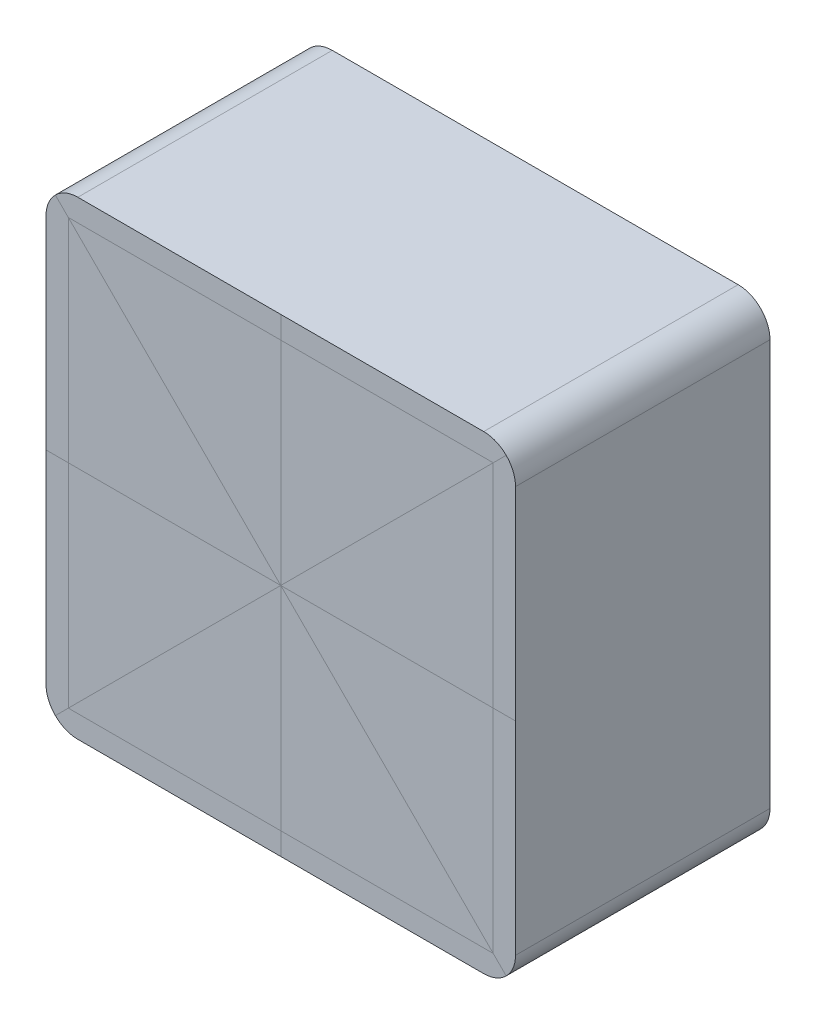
ISO-10303-21;
HEADER;
FILE_DESCRIPTION(('STEP AP214'),'2;1');
FILE_NAME('part.step','',(''),(''),'','','');
FILE_SCHEMA(('AUTOMOTIVE_DESIGN { 1 0 10303 214 1 1 1 1 }'));
ENDSEC;
DATA;
#1=APPLICATION_CONTEXT('core data for automotive mechanical design processes');
#2=APPLICATION_PROTOCOL_DEFINITION('international standard','automotive_design',2000,#1);
#3=PRODUCT_CONTEXT('',#1,'mechanical');
#4=PRODUCT('Part','Part','',(#3));
#5=PRODUCT_RELATED_PRODUCT_CATEGORY('part','',(#4));
#6=PRODUCT_DEFINITION_FORMATION('','',#4);
#7=PRODUCT_DEFINITION_CONTEXT('part definition',#1,'design');
#8=PRODUCT_DEFINITION('design','',#6,#7);
#9=PRODUCT_DEFINITION_SHAPE('','',#8);
#10=(LENGTH_UNIT() NAMED_UNIT(*) SI_UNIT(.MILLI.,.METRE.));
#11=(NAMED_UNIT(*) PLANE_ANGLE_UNIT() SI_UNIT($,.RADIAN.));
#12=(NAMED_UNIT(*) SI_UNIT($,.STERADIAN.) SOLID_ANGLE_UNIT());
#13=UNCERTAINTY_MEASURE_WITH_UNIT(LENGTH_MEASURE(1.E-05),#10,'distance_accuracy_value','');
#14=(GEOMETRIC_REPRESENTATION_CONTEXT(3) GLOBAL_UNCERTAINTY_ASSIGNED_CONTEXT((#13)) GLOBAL_UNIT_ASSIGNED_CONTEXT((#10,
#11,#12)) REPRESENTATION_CONTEXT('',''));
#15=CARTESIAN_POINT('',(0.,0.,0.));
#16=DIRECTION('',(0.,0.,1.));
#17=DIRECTION('',(1.,0.,0.));
#18=AXIS2_PLACEMENT_3D('',#15,#16,#17);
#19=CARTESIAN_POINT('',(7975.599999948,7975.599999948,0.));
#20=DIRECTION('',(0.,0.,1.));
#21=DIRECTION('',(1.,0.,0.));
#22=AXIS2_PLACEMENT_3D('',#19,#20,#21);
#23=PLANE('',#22);
#24=DIRECTION('',(0.,-1.,0.));
#25=VECTOR('',#24,1.);
#26=CARTESIAN_POINT('',(8350.,7975.599999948,0.));
#27=LINE('',#26,#25);
#28=CARTESIAN_POINT('',(8350.,8349.99999999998,0.));
#29=VERTEX_POINT('',#28);
#30=CARTESIAN_POINT('',(8350.,9.91003297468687E-13,0.));
#31=VERTEX_POINT('',#30);
#32=EDGE_CURVE('E11',#29,#31,#27,.T.);
#33=ORIENTED_EDGE('',*,*,#32,.F.);
#34=DIRECTION('',(-0.707106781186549,-0.707106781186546,0.));
#35=VECTOR('',#34,1.);
#36=CARTESIAN_POINT('',(7975.599999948,7975.59999994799,0.));
#37=LINE('',#36,#35);
#38=CARTESIAN_POINT('',(8859.05921239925,8859.05921239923,0.));
#39=VERTEX_POINT('',#38);
#40=EDGE_CURVE('E307',#39,#29,#37,.T.);
#41=ORIENTED_EDGE('',*,*,#40,.F.);
#42=CARTESIAN_POINT('',(7975.599999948,7975.599999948,0.));
#43=DIRECTION('',(0.,0.,1.));
#44=DIRECTION('',(1.,0.,0.));
#45=AXIS2_PLACEMENT_3D('',#42,#43,#44);
#46=CIRCLE('',#45,1249.400000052);
#47=CARTESIAN_POINT('',(9225.,7975.59999994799,0.));
#48=VERTEX_POINT('',#47);
#49=EDGE_CURVE('E547',#48,#39,#46,.T.);
#50=ORIENTED_EDGE('',*,*,#49,.F.);
#51=DIRECTION('',(0.,1.,0.));
#52=VECTOR('',#51,1.);
#53=CARTESIAN_POINT('',(9225.,-7975.59999994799,0.));
#54=LINE('',#53,#52);
#55=CARTESIAN_POINT('',(9225.,0.,0.));
#56=VERTEX_POINT('',#55);
#57=EDGE_CURVE('E504',#56,#48,#54,.T.);
#58=ORIENTED_EDGE('',*,*,#57,.F.);
#59=DIRECTION('',(-1.,0.,0.));
#60=VECTOR('',#59,1.);
#61=CARTESIAN_POINT('',(7975.599999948,8.88178419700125E-13,0.));
#62=LINE('',#61,#60);
#63=EDGE_CURVE('E291',#56,#31,#62,.T.);
#64=ORIENTED_EDGE('',*,*,#63,.T.);
#65=EDGE_LOOP('',(#33,#41,#50,#58,#64));
#66=FACE_BOUND('',#65,.T.);
#67=ADVANCED_FACE('F44',(#66),#23,.F.);
#68=DIRECTION('',(1.,0.,0.));
#69=VECTOR('',#68,1.);
#70=CARTESIAN_POINT('',(7975.599999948,8350.,0.));
#71=LINE('',#70,#69);
#72=CARTESIAN_POINT('',(-3.62148984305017E-12,8350.,0.));
#73=VERTEX_POINT('',#72);
#74=EDGE_CURVE('E54',#73,#29,#71,.T.);
#75=ORIENTED_EDGE('',*,*,#74,.F.);
#76=DIRECTION('',(0.,-1.,0.));
#77=VECTOR('',#76,1.);
#78=CARTESIAN_POINT('',(-3.5527136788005E-12,7975.59999994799,0.));
#79=LINE('',#78,#77);
#80=CARTESIAN_POINT('',(-1.77635683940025E-12,9225.,0.));
#81=VERTEX_POINT('',#80);
#82=EDGE_CURVE('E252',#81,#73,#79,.T.);
#83=ORIENTED_EDGE('',*,*,#82,.F.);
#84=DIRECTION('',(-1.,0.,0.));
#85=VECTOR('',#84,1.);
#86=CARTESIAN_POINT('',(-7975.59999994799,9225.,0.));
#87=LINE('',#86,#85);
#88=CARTESIAN_POINT('',(7975.59999994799,9225.,0.));
#89=VERTEX_POINT('',#88);
#90=EDGE_CURVE('E544',#89,#81,#87,.T.);
#91=ORIENTED_EDGE('',*,*,#90,.F.);
#92=EDGE_CURVE('E236',#39,#89,#46,.T.);
#93=ORIENTED_EDGE('',*,*,#92,.F.);
#94=ORIENTED_EDGE('',*,*,#40,.T.);
#95=EDGE_LOOP('',(#75,#83,#91,#93,#94));
#96=FACE_BOUND('',#95,.T.);
#97=ADVANCED_FACE('F621',(#96),#23,.F.);
#98=DIRECTION('',(1.,0.,0.));
#99=VECTOR('',#98,1.);
#100=CARTESIAN_POINT('',(7975.599999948,8350.,0.));
#101=LINE('',#100,#99);
#102=CARTESIAN_POINT('',(-8350.,8349.99999999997,0.));
#103=VERTEX_POINT('',#102);
#104=EDGE_CURVE('E319',#103,#73,#101,.T.);
#105=ORIENTED_EDGE('',*,*,#104,.F.);
#106=DIRECTION('',(0.707106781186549,-0.707106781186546,0.));
#107=VECTOR('',#106,1.);
#108=CARTESIAN_POINT('',(1.50990331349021E-11,-1.50990331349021E-11,0.));
#109=LINE('',#108,#107);
#110=CARTESIAN_POINT('',(-8859.05921239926,8859.05921239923,0.));
#111=VERTEX_POINT('',#110);
#112=EDGE_CURVE('E279',#111,#103,#109,.T.);
#113=ORIENTED_EDGE('',*,*,#112,.F.);
#114=CARTESIAN_POINT('',(-7975.599999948,7975.599999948,0.));
#115=DIRECTION('',(0.,0.,1.));
#116=DIRECTION('',(-1.,0.,0.));
#117=AXIS2_PLACEMENT_3D('',#114,#115,#116);
#118=CIRCLE('',#117,1249.400000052);
#119=CARTESIAN_POINT('',(-7975.59999994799,9225.,0.));
#120=VERTEX_POINT('',#119);
#121=EDGE_CURVE('E545',#120,#111,#118,.T.);
#122=ORIENTED_EDGE('',*,*,#121,.F.);
#123=EDGE_CURVE('E550',#81,#120,#87,.T.);
#124=ORIENTED_EDGE('',*,*,#123,.F.);
#125=ORIENTED_EDGE('',*,*,#82,.T.);
#126=EDGE_LOOP('',(#105,#113,#122,#124,#125));
#127=FACE_BOUND('',#126,.T.);
#128=ADVANCED_FACE('F627',(#127),#23,.F.);
#129=DIRECTION('',(0.,1.,0.));
#130=VECTOR('',#129,1.);
#131=CARTESIAN_POINT('',(-8350.,7975.59999994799,0.));
#132=LINE('',#131,#130);
#133=CARTESIAN_POINT('',(-8350.,-3.59546961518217E-12,0.));
#134=VERTEX_POINT('',#133);
#135=EDGE_CURVE('E323',#134,#103,#132,.T.);
#136=ORIENTED_EDGE('',*,*,#135,.F.);
#137=DIRECTION('',(-1.,0.,0.));
#138=VECTOR('',#137,1.);
#139=CARTESIAN_POINT('',(7975.599999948,8.88178419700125E-13,0.));
#140=LINE('',#139,#138);
#141=CARTESIAN_POINT('',(-9225.,-2.66453525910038E-12,0.));
#142=VERTEX_POINT('',#141);
#143=EDGE_CURVE('E280',#134,#142,#140,.T.);
#144=ORIENTED_EDGE('',*,*,#143,.T.);
#145=DIRECTION('',(0.,-1.,0.));
#146=VECTOR('',#145,1.);
#147=CARTESIAN_POINT('',(-9225.,-7975.59999994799,0.));
#148=LINE('',#147,#146);
#149=CARTESIAN_POINT('',(-9225.,7975.59999994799,0.));
#150=VERTEX_POINT('',#149);
#151=EDGE_CURVE('E527',#150,#142,#148,.T.);
#152=ORIENTED_EDGE('',*,*,#151,.F.);
#153=EDGE_CURVE('E536',#111,#150,#118,.T.);
#154=ORIENTED_EDGE('',*,*,#153,.F.);
#155=ORIENTED_EDGE('',*,*,#112,.T.);
#156=EDGE_LOOP('',(#136,#144,#152,#154,#155));
#157=FACE_BOUND('',#156,.T.);
#158=ADVANCED_FACE('F532',(#157),#23,.F.);
#159=DIRECTION('',(0.,1.,0.));
#160=VECTOR('',#159,1.);
#161=CARTESIAN_POINT('',(-8350.,7975.59999994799,0.));
#162=LINE('',#161,#160);
#163=CARTESIAN_POINT('',(-8350.00000000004,-8350.00000000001,0.));
#164=VERTEX_POINT('',#163);
#165=EDGE_CURVE('E347',#164,#134,#162,.T.);
#166=ORIENTED_EDGE('',*,*,#165,.F.);
#167=DIRECTION('',(-0.707106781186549,-0.707106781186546,0.));
#168=VECTOR('',#167,1.);
#169=CARTESIAN_POINT('',(7975.599999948,7975.59999994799,0.));
#170=LINE('',#169,#168);
#171=CARTESIAN_POINT('',(-8859.05921239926,-8859.05921239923,0.));
#172=VERTEX_POINT('',#171);
#173=EDGE_CURVE('E308',#164,#172,#170,.T.);
#174=ORIENTED_EDGE('',*,*,#173,.T.);
#175=CARTESIAN_POINT('',(-7975.599999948,-7975.599999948,0.));
#176=DIRECTION('',(0.,0.,1.));
#177=DIRECTION('',(1.,0.,0.));
#178=AXIS2_PLACEMENT_3D('',#175,#176,#177);
#179=CIRCLE('',#178,1249.400000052);
#180=CARTESIAN_POINT('',(-9225.,-7975.59999994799,0.));
#181=VERTEX_POINT('',#180);
#182=EDGE_CURVE('E492',#181,#172,#179,.T.);
#183=ORIENTED_EDGE('',*,*,#182,.F.);
#184=EDGE_CURVE('E541',#142,#181,#148,.T.);
#185=ORIENTED_EDGE('',*,*,#184,.F.);
#186=ORIENTED_EDGE('',*,*,#143,.F.);
#187=EDGE_LOOP('',(#166,#174,#183,#185,#186));
#188=FACE_BOUND('',#187,.T.);
#189=ADVANCED_FACE('F688',(#188),#23,.F.);
#190=DIRECTION('',(-1.,0.,0.));
#191=VECTOR('',#190,1.);
#192=CARTESIAN_POINT('',(7975.599999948,-8350.00000000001,0.));
#193=LINE('',#192,#191);
#194=CARTESIAN_POINT('',(-5.53749611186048E-13,-8350.00000000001,0.));
#195=VERTEX_POINT('',#194);
#196=EDGE_CURVE('E348',#195,#164,#193,.T.);
#197=ORIENTED_EDGE('',*,*,#196,.F.);
#198=CARTESIAN_POINT('',(-1.77635683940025E-12,-9225.,0.));
#199=VERTEX_POINT('',#198);
#200=EDGE_CURVE('E261',#195,#199,#79,.T.);
#201=ORIENTED_EDGE('',*,*,#200,.T.);
#202=DIRECTION('',(1.,0.,0.));
#203=VECTOR('',#202,1.);
#204=CARTESIAN_POINT('',(-7975.59999994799,-9225.,0.));
#205=LINE('',#204,#203);
#206=CARTESIAN_POINT('',(-7975.59999994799,-9225.,0.));
#207=VERTEX_POINT('',#206);
#208=EDGE_CURVE('E485',#207,#199,#205,.T.);
#209=ORIENTED_EDGE('',*,*,#208,.F.);
#210=EDGE_CURVE('E539',#172,#207,#179,.T.);
#211=ORIENTED_EDGE('',*,*,#210,.F.);
#212=ORIENTED_EDGE('',*,*,#173,.F.);
#213=EDGE_LOOP('',(#197,#201,#209,#211,#212));
#214=FACE_BOUND('',#213,.T.);
#215=ADVANCED_FACE('F479',(#214),#23,.F.);
#216=DIRECTION('',(-1.,0.,0.));
#217=VECTOR('',#216,1.);
#218=CARTESIAN_POINT('',(7975.599999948,-8350.00000000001,0.));
#219=LINE('',#218,#217);
#220=CARTESIAN_POINT('',(8350.,-8349.99999999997,0.));
#221=VERTEX_POINT('',#220);
#222=EDGE_CURVE('E336',#221,#195,#219,.T.);
#223=ORIENTED_EDGE('',*,*,#222,.F.);
#224=DIRECTION('',(0.707106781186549,-0.707106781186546,0.));
#225=VECTOR('',#224,1.);
#226=CARTESIAN_POINT('',(1.50990331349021E-11,-1.50990331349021E-11,0.));
#227=LINE('',#226,#225);
#228=CARTESIAN_POINT('',(8859.05921239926,-8859.05921239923,0.));
#229=VERTEX_POINT('',#228);
#230=EDGE_CURVE('E266',#221,#229,#227,.T.);
#231=ORIENTED_EDGE('',*,*,#230,.T.);
#232=CARTESIAN_POINT('',(7975.599999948,-7975.599999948,0.));
#233=DIRECTION('',(0.,0.,1.));
#234=DIRECTION('',(1.,0.,0.));
#235=AXIS2_PLACEMENT_3D('',#232,#233,#234);
#236=CIRCLE('',#235,1249.400000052);
#237=CARTESIAN_POINT('',(7975.59999994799,-9225.,0.));
#238=VERTEX_POINT('',#237);
#239=EDGE_CURVE('E487',#238,#229,#236,.T.);
#240=ORIENTED_EDGE('',*,*,#239,.F.);
#241=EDGE_CURVE('E486',#199,#238,#205,.T.);
#242=ORIENTED_EDGE('',*,*,#241,.F.);
#243=ORIENTED_EDGE('',*,*,#200,.F.);
#244=EDGE_LOOP('',(#223,#231,#240,#242,#243));
#245=FACE_BOUND('',#244,.T.);
#246=ADVANCED_FACE('F490',(#245),#23,.F.);
#247=DIRECTION('',(0.,-1.,0.));
#248=VECTOR('',#247,1.);
#249=CARTESIAN_POINT('',(8350.,7975.599999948,0.));
#250=LINE('',#249,#248);
#251=EDGE_CURVE('E335',#31,#221,#250,.T.);
#252=ORIENTED_EDGE('',*,*,#251,.F.);
#253=ORIENTED_EDGE('',*,*,#63,.F.);
#254=CARTESIAN_POINT('',(9225.,-7975.59999994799,0.));
#255=VERTEX_POINT('',#254);
#256=EDGE_CURVE('E221',#255,#56,#54,.T.);
#257=ORIENTED_EDGE('',*,*,#256,.F.);
#258=EDGE_CURVE('E498',#229,#255,#236,.T.);
#259=ORIENTED_EDGE('',*,*,#258,.F.);
#260=ORIENTED_EDGE('',*,*,#230,.F.);
#261=EDGE_LOOP('',(#252,#253,#257,#259,#260));
#262=FACE_BOUND('',#261,.T.);
#263=ADVANCED_FACE('F595',(#262),#23,.F.);
#264=CARTESIAN_POINT('',(7975.599999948,7975.599999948,10000.));
#265=DIRECTION('',(0.,0.,1.));
#266=DIRECTION('',(1.,0.,0.));
#267=AXIS2_PLACEMENT_3D('',#264,#265,#266);
#268=PLANE('',#267);
#269=DIRECTION('',(-1.,0.,0.));
#270=VECTOR('',#269,1.);
#271=CARTESIAN_POINT('',(7975.599999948,8.88178419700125E-13,10000.));
#272=LINE('',#271,#270);
#273=CARTESIAN_POINT('',(-8350.,-3.59546961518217E-12,10000.));
#274=VERTEX_POINT('',#273);
#275=CARTESIAN_POINT('',(-9225.,-2.66453525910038E-12,10000.));
#276=VERTEX_POINT('',#275);
#277=EDGE_CURVE('E295',#274,#276,#272,.T.);
#278=ORIENTED_EDGE('',*,*,#277,.F.);
#279=DIRECTION('',(0.,1.,0.));
#280=VECTOR('',#279,1.);
#281=CARTESIAN_POINT('',(-8350.,7975.59999994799,10000.));
#282=LINE('',#281,#280);
#283=CARTESIAN_POINT('',(-8350.,8349.99999999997,10000.));
#284=VERTEX_POINT('',#283);
#285=EDGE_CURVE('E330',#274,#284,#282,.T.);
#286=ORIENTED_EDGE('',*,*,#285,.T.);
#287=DIRECTION('',(0.707106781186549,-0.707106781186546,0.));
#288=VECTOR('',#287,1.);
#289=CARTESIAN_POINT('',(1.50990331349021E-11,-1.50990331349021E-11,10000.));
#290=LINE('',#289,#288);
#291=CARTESIAN_POINT('',(-8859.05921239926,8859.05921239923,10000.));
#292=VERTEX_POINT('',#291);
#293=EDGE_CURVE('E268',#292,#284,#290,.T.);
#294=ORIENTED_EDGE('',*,*,#293,.F.);
#295=CARTESIAN_POINT('',(-7975.599999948,7975.599999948,10000.));
#296=DIRECTION('',(0.,0.,1.));
#297=DIRECTION('',(-1.,0.,0.));
#298=AXIS2_PLACEMENT_3D('',#295,#296,#297);
#299=CIRCLE('',#298,1249.400000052);
#300=CARTESIAN_POINT('',(-9225.,7975.59999994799,10000.));
#301=VERTEX_POINT('',#300);
#302=EDGE_CURVE('E231',#292,#301,#299,.T.);
#303=ORIENTED_EDGE('',*,*,#302,.T.);
#304=DIRECTION('',(0.,-1.,0.));
#305=VECTOR('',#304,1.);
#306=CARTESIAN_POINT('',(-9225.,-7975.59999994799,10000.));
#307=LINE('',#306,#305);
#308=EDGE_CURVE('E529',#301,#276,#307,.T.);
#309=ORIENTED_EDGE('',*,*,#308,.T.);
#310=EDGE_LOOP('',(#278,#286,#294,#303,#309));
#311=FACE_BOUND('',#310,.T.);
#312=ADVANCED_FACE('F573',(#311),#268,.T.);
#313=ORIENTED_EDGE('',*,*,#293,.T.);
#314=DIRECTION('',(1.,0.,0.));
#315=VECTOR('',#314,1.);
#316=CARTESIAN_POINT('',(7975.599999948,8350.,10000.));
#317=LINE('',#316,#315);
#318=CARTESIAN_POINT('',(-3.62148984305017E-12,8350.,10000.));
#319=VERTEX_POINT('',#318);
#320=EDGE_CURVE('E322',#284,#319,#317,.T.);
#321=ORIENTED_EDGE('',*,*,#320,.T.);
#322=DIRECTION('',(0.,-1.,0.));
#323=VECTOR('',#322,1.);
#324=CARTESIAN_POINT('',(-3.5527136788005E-12,7975.59999994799,10000.));
#325=LINE('',#324,#323);
#326=CARTESIAN_POINT('',(-1.77635683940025E-12,9225.,10000.));
#327=VERTEX_POINT('',#326);
#328=EDGE_CURVE('E256',#327,#319,#325,.T.);
#329=ORIENTED_EDGE('',*,*,#328,.F.);
#330=DIRECTION('',(-1.,0.,0.));
#331=VECTOR('',#330,1.);
#332=CARTESIAN_POINT('',(-7975.59999994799,9225.,10000.));
#333=LINE('',#332,#331);
#334=CARTESIAN_POINT('',(-7975.59999994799,9225.,10000.));
#335=VERTEX_POINT('',#334);
#336=EDGE_CURVE('E234',#327,#335,#333,.T.);
#337=ORIENTED_EDGE('',*,*,#336,.T.);
#338=EDGE_CURVE('E561',#335,#292,#299,.T.);
#339=ORIENTED_EDGE('',*,*,#338,.T.);
#340=EDGE_LOOP('',(#313,#321,#329,#337,#339));
#341=FACE_BOUND('',#340,.T.);
#342=ADVANCED_FACE('F566',(#341),#268,.T.);
#343=ORIENTED_EDGE('',*,*,#328,.T.);
#344=DIRECTION('',(1.,0.,0.));
#345=VECTOR('',#344,1.);
#346=CARTESIAN_POINT('',(7975.599999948,8350.,10000.));
#347=LINE('',#346,#345);
#348=CARTESIAN_POINT('',(8350.,8349.99999999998,10000.));
#349=VERTEX_POINT('',#348);
#350=EDGE_CURVE('E327',#319,#349,#347,.T.);
#351=ORIENTED_EDGE('',*,*,#350,.T.);
#352=DIRECTION('',(-0.707106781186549,-0.707106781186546,0.));
#353=VECTOR('',#352,1.);
#354=CARTESIAN_POINT('',(7975.599999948,7975.59999994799,10000.));
#355=LINE('',#354,#353);
#356=CARTESIAN_POINT('',(8859.05921239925,8859.05921239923,10000.));
#357=VERTEX_POINT('',#356);
#358=EDGE_CURVE('E217',#357,#349,#355,.T.);
#359=ORIENTED_EDGE('',*,*,#358,.F.);
#360=CARTESIAN_POINT('',(7975.599999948,7975.599999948,10000.));
#361=DIRECTION('',(0.,0.,1.));
#362=DIRECTION('',(1.,0.,0.));
#363=AXIS2_PLACEMENT_3D('',#360,#361,#362);
#364=CIRCLE('',#363,1249.400000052);
#365=CARTESIAN_POINT('',(7975.59999994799,9225.,10000.));
#366=VERTEX_POINT('',#365);
#367=EDGE_CURVE('E215',#357,#366,#364,.T.);
#368=ORIENTED_EDGE('',*,*,#367,.T.);
#369=EDGE_CURVE('E216',#366,#327,#333,.T.);
#370=ORIENTED_EDGE('',*,*,#369,.T.);
#371=EDGE_LOOP('',(#343,#351,#359,#368,#370));
#372=FACE_BOUND('',#371,.T.);
#373=ADVANCED_FACE('F214',(#372),#268,.T.);
#374=ORIENTED_EDGE('',*,*,#358,.T.);
#375=DIRECTION('',(0.,-1.,0.));
#376=VECTOR('',#375,1.);
#377=CARTESIAN_POINT('',(8350.,7975.599999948,10000.));
#378=LINE('',#377,#376);
#379=CARTESIAN_POINT('',(8350.,9.91003297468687E-13,10000.));
#380=VERTEX_POINT('',#379);
#381=EDGE_CURVE('E329',#349,#380,#378,.T.);
#382=ORIENTED_EDGE('',*,*,#381,.T.);
#383=DIRECTION('',(-1.,0.,0.));
#384=VECTOR('',#383,1.);
#385=CARTESIAN_POINT('',(7975.599999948,8.88178419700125E-13,10000.));
#386=LINE('',#385,#384);
#387=CARTESIAN_POINT('',(9225.,0.,10000.));
#388=VERTEX_POINT('',#387);
#389=EDGE_CURVE('E285',#388,#380,#386,.T.);
#390=ORIENTED_EDGE('',*,*,#389,.F.);
#391=DIRECTION('',(0.,1.,0.));
#392=VECTOR('',#391,1.);
#393=CARTESIAN_POINT('',(9225.,-7975.59999994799,10000.));
#394=LINE('',#393,#392);
#395=CARTESIAN_POINT('',(9225.,7975.59999994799,10000.));
#396=VERTEX_POINT('',#395);
#397=EDGE_CURVE('E555',#388,#396,#394,.T.);
#398=ORIENTED_EDGE('',*,*,#397,.T.);
#399=EDGE_CURVE('E224',#396,#357,#364,.T.);
#400=ORIENTED_EDGE('',*,*,#399,.T.);
#401=EDGE_LOOP('',(#374,#382,#390,#398,#400));
#402=FACE_BOUND('',#401,.T.);
#403=ADVANCED_FACE('F660',(#402),#268,.T.);
#404=ORIENTED_EDGE('',*,*,#389,.T.);
#405=DIRECTION('',(0.,-1.,0.));
#406=VECTOR('',#405,1.);
#407=CARTESIAN_POINT('',(8350.,7975.599999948,10000.));
#408=LINE('',#407,#406);
#409=CARTESIAN_POINT('',(8350.,-8349.99999999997,10000.));
#410=VERTEX_POINT('',#409);
#411=EDGE_CURVE('E338',#380,#410,#408,.T.);
#412=ORIENTED_EDGE('',*,*,#411,.T.);
#413=DIRECTION('',(0.707106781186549,-0.707106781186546,0.));
#414=VECTOR('',#413,1.);
#415=CARTESIAN_POINT('',(1.50990331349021E-11,-1.50990331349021E-11,10000.));
#416=LINE('',#415,#414);
#417=CARTESIAN_POINT('',(8859.05921239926,-8859.05921239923,10000.));
#418=VERTEX_POINT('',#417);
#419=EDGE_CURVE('E270',#410,#418,#416,.T.);
#420=ORIENTED_EDGE('',*,*,#419,.T.);
#421=CARTESIAN_POINT('',(7975.599999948,-7975.599999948,10000.));
#422=DIRECTION('',(0.,0.,1.));
#423=DIRECTION('',(1.,0.,0.));
#424=AXIS2_PLACEMENT_3D('',#421,#422,#423);
#425=CIRCLE('',#424,1249.400000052);
#426=CARTESIAN_POINT('',(9225.,-7975.59999994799,10000.));
#427=VERTEX_POINT('',#426);
#428=EDGE_CURVE('E556',#418,#427,#425,.T.);
#429=ORIENTED_EDGE('',*,*,#428,.T.);
#430=EDGE_CURVE('E515',#427,#388,#394,.T.);
#431=ORIENTED_EDGE('',*,*,#430,.T.);
#432=EDGE_LOOP('',(#404,#412,#420,#429,#431));
#433=FACE_BOUND('',#432,.T.);
#434=ADVANCED_FACE('F656',(#433),#268,.T.);
#435=ORIENTED_EDGE('',*,*,#419,.F.);
#436=DIRECTION('',(-1.,0.,0.));
#437=VECTOR('',#436,1.);
#438=CARTESIAN_POINT('',(7975.599999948,-8350.00000000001,10000.));
#439=LINE('',#438,#437);
#440=CARTESIAN_POINT('',(-5.53749611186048E-13,-8350.00000000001,10000.));
#441=VERTEX_POINT('',#440);
#442=EDGE_CURVE('E345',#410,#441,#439,.T.);
#443=ORIENTED_EDGE('',*,*,#442,.T.);
#444=CARTESIAN_POINT('',(-1.77635683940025E-12,-9225.,10000.));
#445=VERTEX_POINT('',#444);
#446=EDGE_CURVE('E238',#441,#445,#325,.T.);
#447=ORIENTED_EDGE('',*,*,#446,.T.);
#448=DIRECTION('',(1.,0.,0.));
#449=VECTOR('',#448,1.);
#450=CARTESIAN_POINT('',(-7975.59999994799,-9225.,10000.));
#451=LINE('',#450,#449);
#452=CARTESIAN_POINT('',(7975.59999994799,-9225.,10000.));
#453=VERTEX_POINT('',#452);
#454=EDGE_CURVE('E558',#445,#453,#451,.T.);
#455=ORIENTED_EDGE('',*,*,#454,.T.);
#456=EDGE_CURVE('E554',#453,#418,#425,.T.);
#457=ORIENTED_EDGE('',*,*,#456,.T.);
#458=EDGE_LOOP('',(#435,#443,#447,#455,#457));
#459=FACE_BOUND('',#458,.T.);
#460=ADVANCED_FACE('F654',(#459),#268,.T.);
#461=ORIENTED_EDGE('',*,*,#446,.F.);
#462=DIRECTION('',(-1.,0.,0.));
#463=VECTOR('',#462,1.);
#464=CARTESIAN_POINT('',(7975.599999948,-8350.00000000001,10000.));
#465=LINE('',#464,#463);
#466=CARTESIAN_POINT('',(-8350.00000000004,-8350.00000000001,10000.));
#467=VERTEX_POINT('',#466);
#468=EDGE_CURVE('E47',#441,#467,#465,.T.);
#469=ORIENTED_EDGE('',*,*,#468,.T.);
#470=DIRECTION('',(-0.707106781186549,-0.707106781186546,0.));
#471=VECTOR('',#470,1.);
#472=CARTESIAN_POINT('',(7975.599999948,7975.59999994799,10000.));
#473=LINE('',#472,#471);
#474=CARTESIAN_POINT('',(-8859.05921239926,-8859.05921239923,10000.));
#475=VERTEX_POINT('',#474);
#476=EDGE_CURVE('E303',#467,#475,#473,.T.);
#477=ORIENTED_EDGE('',*,*,#476,.T.);
#478=CARTESIAN_POINT('',(-7975.599999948,-7975.599999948,10000.));
#479=DIRECTION('',(0.,0.,1.));
#480=DIRECTION('',(1.,0.,0.));
#481=AXIS2_PLACEMENT_3D('',#478,#479,#480);
#482=CIRCLE('',#481,1249.400000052);
#483=CARTESIAN_POINT('',(-7975.59999994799,-9225.,10000.));
#484=VERTEX_POINT('',#483);
#485=EDGE_CURVE('E562',#475,#484,#482,.T.);
#486=ORIENTED_EDGE('',*,*,#485,.T.);
#487=EDGE_CURVE('E560',#484,#445,#451,.T.);
#488=ORIENTED_EDGE('',*,*,#487,.T.);
#489=EDGE_LOOP('',(#461,#469,#477,#486,#488));
#490=FACE_BOUND('',#489,.T.);
#491=ADVANCED_FACE('F372',(#490),#268,.T.);
#492=ORIENTED_EDGE('',*,*,#476,.F.);
#493=DIRECTION('',(0.,1.,0.));
#494=VECTOR('',#493,1.);
#495=CARTESIAN_POINT('',(-8350.,7975.59999994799,10000.));
#496=LINE('',#495,#494);
#497=EDGE_CURVE('E312',#467,#274,#496,.T.);
#498=ORIENTED_EDGE('',*,*,#497,.T.);
#499=ORIENTED_EDGE('',*,*,#277,.T.);
#500=CARTESIAN_POINT('',(-9225.,-7975.59999994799,10000.));
#501=VERTEX_POINT('',#500);
#502=EDGE_CURVE('E564',#276,#501,#307,.T.);
#503=ORIENTED_EDGE('',*,*,#502,.T.);
#504=EDGE_CURVE('E388',#501,#475,#482,.T.);
#505=ORIENTED_EDGE('',*,*,#504,.T.);
#506=EDGE_LOOP('',(#492,#498,#499,#503,#505));
#507=FACE_BOUND('',#506,.T.);
#508=ADVANCED_FACE('F389',(#507),#268,.T.);
#509=ORIENTED_EDGE('',*,*,#468,.F.);
#510=CARTESIAN_POINT('',(-2.67593781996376E-12,3.85257400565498E-12,10000.));
#511=VERTEX_POINT('',#510);
#512=EDGE_CURVE('E243',#511,#441,#325,.T.);
#513=ORIENTED_EDGE('',*,*,#512,.F.);
#514=EDGE_CURVE('E313',#511,#467,#473,.T.);
#515=ORIENTED_EDGE('',*,*,#514,.T.);
#516=EDGE_LOOP('',(#509,#513,#515));
#517=FACE_BOUND('',#516,.T.);
#518=ADVANCED_FACE('F395',(#517),#268,.T.);
#519=CARTESIAN_POINT('',(-2.67593781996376E-12,3.85257400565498E-12,0.));
#520=VERTEX_POINT('',#519);
#521=EDGE_CURVE('E260',#520,#195,#79,.T.);
#522=ORIENTED_EDGE('',*,*,#521,.T.);
#523=ORIENTED_EDGE('',*,*,#196,.T.);
#524=EDGE_CURVE('E302',#520,#164,#170,.T.);
#525=ORIENTED_EDGE('',*,*,#524,.F.);
#526=EDGE_LOOP('',(#522,#523,#525));
#527=FACE_BOUND('',#526,.T.);
#528=ADVANCED_FACE('F609',(#527),#23,.F.);
#529=EDGE_CURVE('E309',#29,#520,#37,.T.);
#530=ORIENTED_EDGE('',*,*,#529,.F.);
#531=ORIENTED_EDGE('',*,*,#32,.T.);
#532=EDGE_CURVE('E287',#31,#520,#62,.T.);
#533=ORIENTED_EDGE('',*,*,#532,.T.);
#534=EDGE_LOOP('',(#530,#531,#533));
#535=FACE_BOUND('',#534,.T.);
#536=ADVANCED_FACE('F608',(#535),#23,.F.);
#537=ORIENTED_EDGE('',*,*,#381,.F.);
#538=EDGE_CURVE('E296',#349,#511,#355,.T.);
#539=ORIENTED_EDGE('',*,*,#538,.T.);
#540=EDGE_CURVE('E290',#380,#511,#386,.T.);
#541=ORIENTED_EDGE('',*,*,#540,.F.);
#542=EDGE_LOOP('',(#537,#539,#541));
#543=FACE_BOUND('',#542,.T.);
#544=ADVANCED_FACE('F418',(#543),#268,.T.);
#545=ORIENTED_EDGE('',*,*,#532,.F.);
#546=ORIENTED_EDGE('',*,*,#251,.T.);
#547=EDGE_CURVE('E272',#520,#221,#227,.T.);
#548=ORIENTED_EDGE('',*,*,#547,.F.);
#549=EDGE_LOOP('',(#545,#546,#548));
#550=FACE_BOUND('',#549,.T.);
#551=ADVANCED_FACE('F620',(#550),#23,.F.);
#552=ORIENTED_EDGE('',*,*,#411,.F.);
#553=ORIENTED_EDGE('',*,*,#540,.T.);
#554=EDGE_CURVE('E265',#511,#410,#416,.T.);
#555=ORIENTED_EDGE('',*,*,#554,.T.);
#556=EDGE_LOOP('',(#552,#553,#555));
#557=FACE_BOUND('',#556,.T.);
#558=ADVANCED_FACE('F420',(#557),#268,.T.);
#559=ORIENTED_EDGE('',*,*,#497,.F.);
#560=ORIENTED_EDGE('',*,*,#514,.F.);
#561=EDGE_CURVE('E289',#511,#274,#272,.T.);
#562=ORIENTED_EDGE('',*,*,#561,.T.);
#563=EDGE_LOOP('',(#559,#560,#562));
#564=FACE_BOUND('',#563,.T.);
#565=ADVANCED_FACE('F382',(#564),#268,.T.);
#566=ORIENTED_EDGE('',*,*,#524,.T.);
#567=ORIENTED_EDGE('',*,*,#165,.T.);
#568=EDGE_CURVE('E300',#520,#134,#140,.T.);
#569=ORIENTED_EDGE('',*,*,#568,.F.);
#570=EDGE_LOOP('',(#566,#567,#569));
#571=FACE_BOUND('',#570,.T.);
#572=ADVANCED_FACE('F607',(#571),#23,.F.);
#573=EDGE_CURVE('E258',#73,#520,#79,.T.);
#574=ORIENTED_EDGE('',*,*,#573,.F.);
#575=ORIENTED_EDGE('',*,*,#74,.T.);
#576=ORIENTED_EDGE('',*,*,#529,.T.);
#577=EDGE_LOOP('',(#574,#575,#576));
#578=FACE_BOUND('',#577,.T.);
#579=ADVANCED_FACE('F642',(#578),#23,.F.);
#580=ORIENTED_EDGE('',*,*,#350,.F.);
#581=EDGE_CURVE('E247',#319,#511,#325,.T.);
#582=ORIENTED_EDGE('',*,*,#581,.T.);
#583=ORIENTED_EDGE('',*,*,#538,.F.);
#584=EDGE_LOOP('',(#580,#582,#583));
#585=FACE_BOUND('',#584,.T.);
#586=ADVANCED_FACE('F408',(#585),#268,.T.);
#587=ORIENTED_EDGE('',*,*,#320,.F.);
#588=EDGE_CURVE('E275',#284,#511,#290,.T.);
#589=ORIENTED_EDGE('',*,*,#588,.T.);
#590=ORIENTED_EDGE('',*,*,#581,.F.);
#591=EDGE_LOOP('',(#587,#589,#590));
#592=FACE_BOUND('',#591,.T.);
#593=ADVANCED_FACE('F577',(#592),#268,.T.);
#594=EDGE_CURVE('E254',#103,#520,#109,.T.);
#595=ORIENTED_EDGE('',*,*,#594,.F.);
#596=ORIENTED_EDGE('',*,*,#104,.T.);
#597=ORIENTED_EDGE('',*,*,#573,.T.);
#598=EDGE_LOOP('',(#595,#596,#597));
#599=FACE_BOUND('',#598,.T.);
#600=ADVANCED_FACE('F636',(#599),#23,.F.);
#601=ORIENTED_EDGE('',*,*,#547,.T.);
#602=ORIENTED_EDGE('',*,*,#222,.T.);
#603=ORIENTED_EDGE('',*,*,#521,.F.);
#604=EDGE_LOOP('',(#601,#602,#603));
#605=FACE_BOUND('',#604,.T.);
#606=ADVANCED_FACE('F632',(#605),#23,.F.);
#607=ORIENTED_EDGE('',*,*,#442,.F.);
#608=ORIENTED_EDGE('',*,*,#554,.F.);
#609=ORIENTED_EDGE('',*,*,#512,.T.);
#610=EDGE_LOOP('',(#607,#608,#609));
#611=FACE_BOUND('',#610,.T.);
#612=ADVANCED_FACE('F638',(#611),#268,.T.);
#613=CARTESIAN_POINT('',(7975.599999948,7975.599999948,10000.));
#614=DIRECTION('',(0.,0.,-1.));
#615=DIRECTION('',(-1.,0.,0.));
#616=AXIS2_PLACEMENT_3D('',#613,#614,#615);
#617=CYLINDRICAL_SURFACE('',#616,1249.400000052);
#618=ORIENTED_EDGE('',*,*,#49,.T.);
#619=ORIENTED_EDGE('',*,*,#92,.T.);
#620=DIRECTION('',(0.,0.,-1.));
#621=VECTOR('',#620,1.);
#622=CARTESIAN_POINT('',(7975.59999994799,9225.,10000.));
#623=LINE('',#622,#621);
#624=EDGE_CURVE('E232',#366,#89,#623,.T.);
#625=ORIENTED_EDGE('',*,*,#624,.F.);
#626=ORIENTED_EDGE('',*,*,#367,.F.);
#627=ORIENTED_EDGE('',*,*,#399,.F.);
#628=DIRECTION('',(0.,0.,-1.));
#629=VECTOR('',#628,1.);
#630=CARTESIAN_POINT('',(9225.,7975.59999994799,10000.));
#631=LINE('',#630,#629);
#632=EDGE_CURVE('E509',#396,#48,#631,.T.);
#633=ORIENTED_EDGE('',*,*,#632,.T.);
#634=EDGE_LOOP('',(#618,#619,#625,#626,#627,#633));
#635=FACE_BOUND('',#634,.T.);
#636=ADVANCED_FACE('F50',(#635),#617,.T.);
#637=CARTESIAN_POINT('',(-7975.59999994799,9225.,10000.));
#638=DIRECTION('',(0.,-1.,0.));
#639=DIRECTION('',(0.,0.,-1.));
#640=AXIS2_PLACEMENT_3D('',#637,#638,#639);
#641=PLANE('',#640);
#642=ORIENTED_EDGE('',*,*,#90,.T.);
#643=ORIENTED_EDGE('',*,*,#123,.T.);
#644=DIRECTION('',(0.,0.,-1.));
#645=VECTOR('',#644,1.);
#646=CARTESIAN_POINT('',(-7975.59999994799,9225.,10000.));
#647=LINE('',#646,#645);
#648=EDGE_CURVE('E241',#335,#120,#647,.T.);
#649=ORIENTED_EDGE('',*,*,#648,.F.);
#650=ORIENTED_EDGE('',*,*,#336,.F.);
#651=ORIENTED_EDGE('',*,*,#369,.F.);
#652=ORIENTED_EDGE('',*,*,#624,.T.);
#653=EDGE_LOOP('',(#642,#643,#649,#650,#651,#652));
#654=FACE_BOUND('',#653,.T.);
#655=ADVANCED_FACE('F229',(#654),#641,.F.);
#656=CARTESIAN_POINT('',(-7975.599999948,7975.599999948,10000.));
#657=DIRECTION('',(0.,0.,-1.));
#658=DIRECTION('',(-1.,0.,0.));
#659=AXIS2_PLACEMENT_3D('',#656,#657,#658);
#660=CYLINDRICAL_SURFACE('',#659,1249.400000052);
#661=ORIENTED_EDGE('',*,*,#121,.T.);
#662=ORIENTED_EDGE('',*,*,#153,.T.);
#663=DIRECTION('',(0.,0.,-1.));
#664=VECTOR('',#663,1.);
#665=CARTESIAN_POINT('',(-9225.,7975.59999994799,10000.));
#666=LINE('',#665,#664);
#667=EDGE_CURVE('E249',#301,#150,#666,.T.);
#668=ORIENTED_EDGE('',*,*,#667,.F.);
#669=ORIENTED_EDGE('',*,*,#302,.F.);
#670=ORIENTED_EDGE('',*,*,#338,.F.);
#671=ORIENTED_EDGE('',*,*,#648,.T.);
#672=EDGE_LOOP('',(#661,#662,#668,#669,#670,#671));
#673=FACE_BOUND('',#672,.T.);
#674=ADVANCED_FACE('F575',(#673),#660,.T.);
#675=CARTESIAN_POINT('',(-9225.,-7975.59999994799,10000.));
#676=DIRECTION('',(1.,0.,0.));
#677=DIRECTION('',(0.,0.,-1.));
#678=AXIS2_PLACEMENT_3D('',#675,#676,#677);
#679=PLANE('',#678);
#680=ORIENTED_EDGE('',*,*,#151,.T.);
#681=ORIENTED_EDGE('',*,*,#184,.T.);
#682=DIRECTION('',(0.,0.,-1.));
#683=VECTOR('',#682,1.);
#684=CARTESIAN_POINT('',(-9225.,-7975.59999994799,10000.));
#685=LINE('',#684,#683);
#686=EDGE_CURVE('E517',#501,#181,#685,.T.);
#687=ORIENTED_EDGE('',*,*,#686,.F.);
#688=ORIENTED_EDGE('',*,*,#502,.F.);
#689=ORIENTED_EDGE('',*,*,#308,.F.);
#690=ORIENTED_EDGE('',*,*,#667,.T.);
#691=EDGE_LOOP('',(#680,#681,#687,#688,#689,#690));
#692=FACE_BOUND('',#691,.T.);
#693=ADVANCED_FACE('F528',(#692),#679,.F.);
#694=CARTESIAN_POINT('',(-7975.599999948,-7975.599999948,10000.));
#695=DIRECTION('',(0.,0.,-1.));
#696=DIRECTION('',(-1.,0.,0.));
#697=AXIS2_PLACEMENT_3D('',#694,#695,#696);
#698=CYLINDRICAL_SURFACE('',#697,1249.400000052);
#699=ORIENTED_EDGE('',*,*,#182,.T.);
#700=ORIENTED_EDGE('',*,*,#210,.T.);
#701=DIRECTION('',(0.,0.,-1.));
#702=VECTOR('',#701,1.);
#703=CARTESIAN_POINT('',(-7975.59999994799,-9225.,10000.));
#704=LINE('',#703,#702);
#705=EDGE_CURVE('E496',#484,#207,#704,.T.);
#706=ORIENTED_EDGE('',*,*,#705,.F.);
#707=ORIENTED_EDGE('',*,*,#485,.F.);
#708=ORIENTED_EDGE('',*,*,#504,.F.);
#709=ORIENTED_EDGE('',*,*,#686,.T.);
#710=EDGE_LOOP('',(#699,#700,#706,#707,#708,#709));
#711=FACE_BOUND('',#710,.T.);
#712=ADVANCED_FACE('F601',(#711),#698,.T.);
#713=CARTESIAN_POINT('',(-7975.59999994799,-9225.,10000.));
#714=DIRECTION('',(0.,1.,0.));
#715=DIRECTION('',(0.,0.,1.));
#716=AXIS2_PLACEMENT_3D('',#713,#714,#715);
#717=PLANE('',#716);
#718=ORIENTED_EDGE('',*,*,#208,.T.);
#719=ORIENTED_EDGE('',*,*,#241,.T.);
#720=DIRECTION('',(0.,0.,-1.));
#721=VECTOR('',#720,1.);
#722=CARTESIAN_POINT('',(7975.59999994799,-9225.,10000.));
#723=LINE('',#722,#721);
#724=EDGE_CURVE('E513',#453,#238,#723,.T.);
#725=ORIENTED_EDGE('',*,*,#724,.F.);
#726=ORIENTED_EDGE('',*,*,#454,.F.);
#727=ORIENTED_EDGE('',*,*,#487,.F.);
#728=ORIENTED_EDGE('',*,*,#705,.T.);
#729=EDGE_LOOP('',(#718,#719,#725,#726,#727,#728));
#730=FACE_BOUND('',#729,.T.);
#731=ADVANCED_FACE('F497',(#730),#717,.F.);
#732=CARTESIAN_POINT('',(7975.599999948,-7975.599999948,10000.));
#733=DIRECTION('',(0.,0.,-1.));
#734=DIRECTION('',(-1.,0.,0.));
#735=AXIS2_PLACEMENT_3D('',#732,#733,#734);
#736=CYLINDRICAL_SURFACE('',#735,1249.400000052);
#737=ORIENTED_EDGE('',*,*,#239,.T.);
#738=ORIENTED_EDGE('',*,*,#258,.T.);
#739=DIRECTION('',(0.,0.,-1.));
#740=VECTOR('',#739,1.);
#741=CARTESIAN_POINT('',(9225.,-7975.59999994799,10000.));
#742=LINE('',#741,#740);
#743=EDGE_CURVE('E512',#427,#255,#742,.T.);
#744=ORIENTED_EDGE('',*,*,#743,.F.);
#745=ORIENTED_EDGE('',*,*,#428,.F.);
#746=ORIENTED_EDGE('',*,*,#456,.F.);
#747=ORIENTED_EDGE('',*,*,#724,.T.);
#748=EDGE_LOOP('',(#737,#738,#744,#745,#746,#747));
#749=FACE_BOUND('',#748,.T.);
#750=ADVANCED_FACE('F594',(#749),#736,.T.);
#751=CARTESIAN_POINT('',(9225.,-7975.59999994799,10000.));
#752=DIRECTION('',(-1.,0.,0.));
#753=DIRECTION('',(0.,0.,1.));
#754=AXIS2_PLACEMENT_3D('',#751,#752,#753);
#755=PLANE('',#754);
#756=ORIENTED_EDGE('',*,*,#256,.T.);
#757=ORIENTED_EDGE('',*,*,#57,.T.);
#758=ORIENTED_EDGE('',*,*,#632,.F.);
#759=ORIENTED_EDGE('',*,*,#397,.F.);
#760=ORIENTED_EDGE('',*,*,#430,.F.);
#761=ORIENTED_EDGE('',*,*,#743,.T.);
#762=EDGE_LOOP('',(#756,#757,#758,#759,#760,#761));
#763=FACE_BOUND('',#762,.T.);
#764=ADVANCED_FACE('F633',(#763),#755,.F.);
#765=ORIENTED_EDGE('',*,*,#285,.F.);
#766=ORIENTED_EDGE('',*,*,#561,.F.);
#767=ORIENTED_EDGE('',*,*,#588,.F.);
#768=EDGE_LOOP('',(#765,#766,#767));
#769=FACE_BOUND('',#768,.T.);
#770=ADVANCED_FACE('F579',(#769),#268,.T.);
#771=ORIENTED_EDGE('',*,*,#568,.T.);
#772=ORIENTED_EDGE('',*,*,#135,.T.);
#773=ORIENTED_EDGE('',*,*,#594,.T.);
#774=EDGE_LOOP('',(#771,#772,#773));
#775=FACE_BOUND('',#774,.T.);
#776=ADVANCED_FACE('F616',(#775),#23,.F.);
#777=CLOSED_SHELL('',(#67,#97,#128,#158,#189,#215,#246,#263,#312,#342,#373,#403,#434,#460,#491,
#508,#518,#528,#536,#544,#551,#558,#565,#572,#579,#586,#593,#600,#606,#612,#636,#655,#674,#693,
#712,#731,#750,#764,#770,#776));
#778=MANIFOLD_SOLID_BREP('B2',#777);
#779=ADVANCED_BREP_SHAPE_REPRESENTATION('',(#18,#778),#14);
#780=SHAPE_DEFINITION_REPRESENTATION(#9,#779);
ENDSEC;
END-ISO-10303-21;
